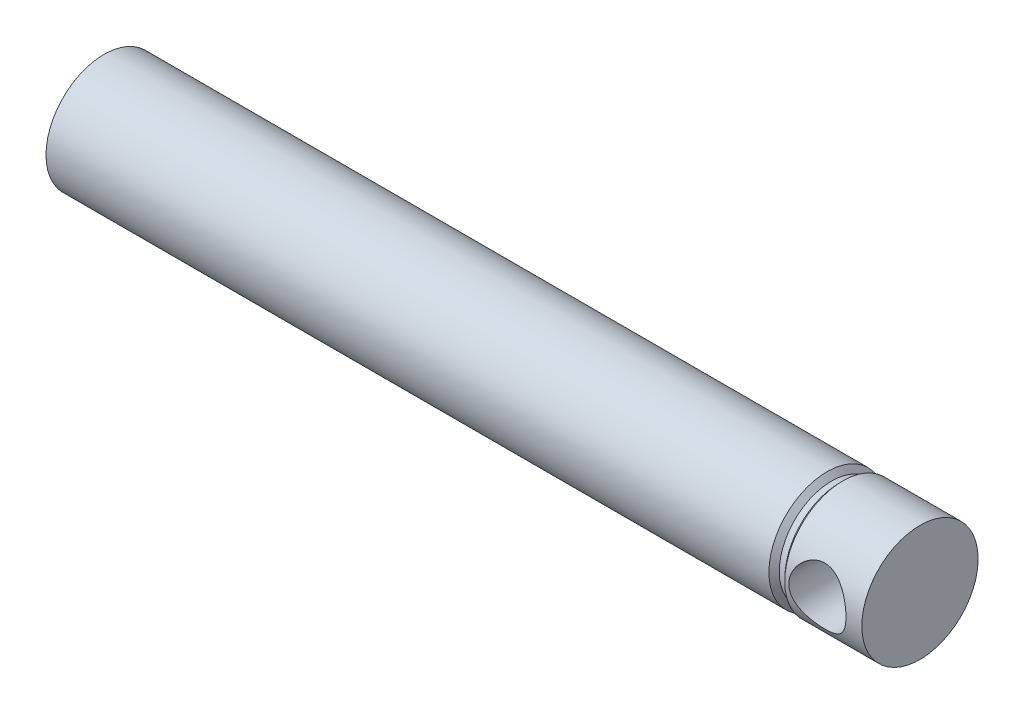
from build123d import *

# Parameters (mm, degrees)
ESQUISSE2_R             = 7
ENL_V_MAT_EXTRU_1_DEPTH = 14.5


with BuildPart() as part:
    # Esquisse1 → Base-R_volution (revolve)
    with BuildSketch(Plane.XY, mode=Mode.PRIVATE) as base_r_volution_sk:
        Polygon((90, 0), (90, 14.25), (71.1, 14.25), (70.253032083, 13.360615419), (68.335350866, 12.827926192), (67.21670349, 14.25), (-110, 14.25), (-110, 0), align=None)
    revolve(base_r_volution_sk.sketch.rotate(Axis((-110, 0, 0), (1, 0, 0)), 90), axis=Axis((-110, 0, 0), (1, 0, 0)))

    # Esquisse2 → Enl_v. mat.-Extru.1 (cut, symmetric)
    with BuildSketch(Plane.XY):
        with Locations((79.1, 0)):
            Circle(ESQUISSE2_R)
    extrude(amount=ENL_V_MAT_EXTRU_1_DEPTH, both=True, mode=Mode.SUBTRACT)


solid = part.part
